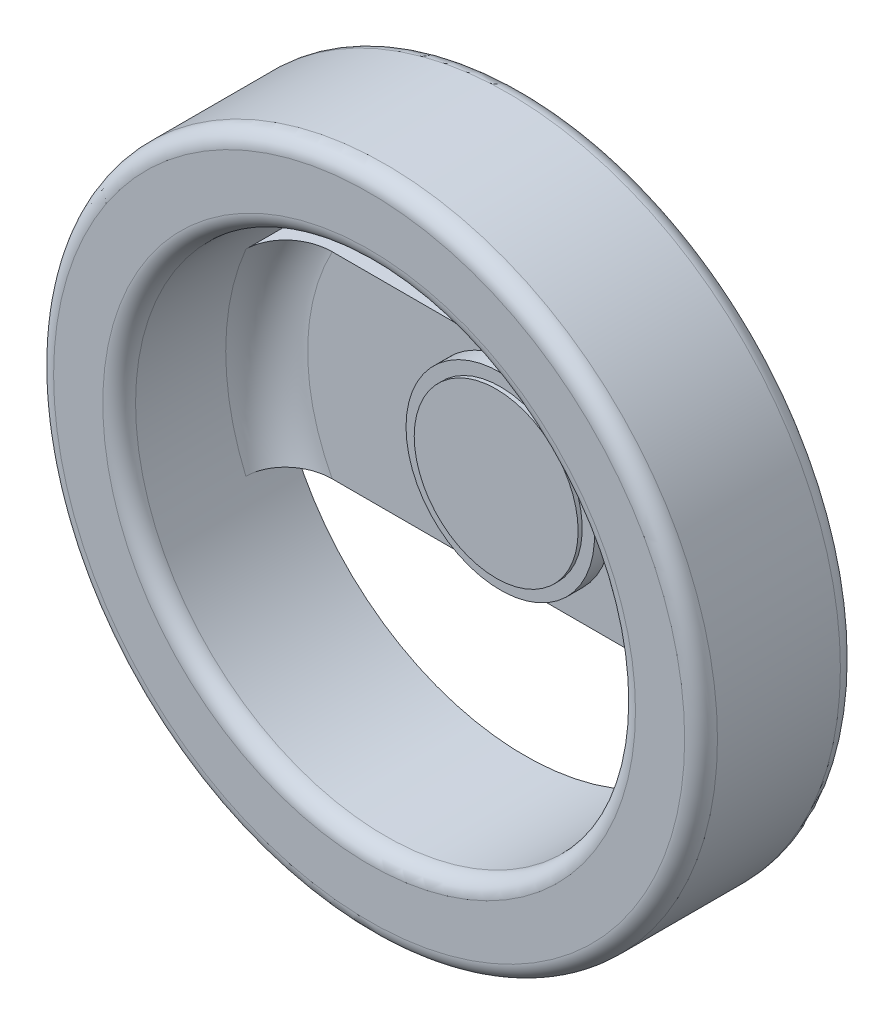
ISO-10303-21;
HEADER;
FILE_DESCRIPTION(('STEP AP214'),'2;1');
FILE_NAME('part.step','',(''),(''),'','','');
FILE_SCHEMA(('AUTOMOTIVE_DESIGN { 1 0 10303 214 1 1 1 1 }'));
ENDSEC;
DATA;
#1=APPLICATION_CONTEXT('core data for automotive mechanical design processes');
#2=APPLICATION_PROTOCOL_DEFINITION('international standard','automotive_design',2000,#1);
#3=PRODUCT_CONTEXT('',#1,'mechanical');
#4=PRODUCT('Part','Part','',(#3));
#5=PRODUCT_RELATED_PRODUCT_CATEGORY('part','',(#4));
#6=PRODUCT_DEFINITION_FORMATION('','',#4);
#7=PRODUCT_DEFINITION_CONTEXT('part definition',#1,'design');
#8=PRODUCT_DEFINITION('design','',#6,#7);
#9=PRODUCT_DEFINITION_SHAPE('','',#8);
#10=(LENGTH_UNIT() NAMED_UNIT(*) SI_UNIT(.MILLI.,.METRE.));
#11=(NAMED_UNIT(*) PLANE_ANGLE_UNIT() SI_UNIT($,.RADIAN.));
#12=(NAMED_UNIT(*) SI_UNIT($,.STERADIAN.) SOLID_ANGLE_UNIT());
#13=UNCERTAINTY_MEASURE_WITH_UNIT(LENGTH_MEASURE(1.E-05),#10,'distance_accuracy_value','');
#14=(GEOMETRIC_REPRESENTATION_CONTEXT(3) GLOBAL_UNCERTAINTY_ASSIGNED_CONTEXT((#13)) GLOBAL_UNIT_ASSIGNED_CONTEXT((#10,
#11,#12)) REPRESENTATION_CONTEXT('',''));
#15=CARTESIAN_POINT('',(0.,0.,0.));
#16=DIRECTION('',(0.,0.,1.));
#17=DIRECTION('',(1.,0.,0.));
#18=AXIS2_PLACEMENT_3D('',#15,#16,#17);
#19=CARTESIAN_POINT('',(0.,0.,2.99999999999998));
#20=DIRECTION('',(0.,0.,-1.));
#21=DIRECTION('',(-1.,0.,0.));
#22=AXIS2_PLACEMENT_3D('',#19,#20,#21);
#23=PLANE('',#22);
#24=CARTESIAN_POINT('',(0.,0.,2.99999999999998));
#25=DIRECTION('',(0.,0.,-1.));
#26=DIRECTION('',(-1.,0.,0.));
#27=AXIS2_PLACEMENT_3D('',#24,#25,#26);
#28=CIRCLE('',#27,11.5);
#29=CARTESIAN_POINT('',(-11.5,0.,2.99999999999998));
#30=VERTEX_POINT('',#29);
#31=EDGE_CURVE('E148',#30,#30,#28,.T.);
#32=ORIENTED_EDGE('',*,*,#31,.F.);
#33=EDGE_LOOP('',(#32));
#34=FACE_BOUND('',#33,.T.);
#35=CARTESIAN_POINT('',(0.,0.,2.99999999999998));
#36=DIRECTION('',(0.,0.,-1.));
#37=DIRECTION('',(-1.,0.,0.));
#38=AXIS2_PLACEMENT_3D('',#35,#36,#37);
#39=CIRCLE('',#38,10.);
#40=CARTESIAN_POINT('',(-10.,0.,2.99999999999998));
#41=VERTEX_POINT('',#40);
#42=EDGE_CURVE('E11',#41,#41,#39,.F.);
#43=ORIENTED_EDGE('',*,*,#42,.F.);
#44=EDGE_LOOP('',(#43));
#45=FACE_BOUND('',#44,.T.);
#46=ADVANCED_FACE('F26',(#34,#45),#23,.F.);
#47=CARTESIAN_POINT('',(0.,0.,0.));
#48=DIRECTION('',(0.,0.,1.));
#49=DIRECTION('',(1.,0.,0.));
#50=AXIS2_PLACEMENT_3D('',#47,#48,#49);
#51=PLANE('',#50);
#52=CARTESIAN_POINT('',(0.,0.,0.));
#53=DIRECTION('',(0.,0.,1.));
#54=DIRECTION('',(1.,0.,0.));
#55=AXIS2_PLACEMENT_3D('',#52,#53,#54);
#56=CIRCLE('',#55,38.5);
#57=CARTESIAN_POINT('',(38.5,0.,0.));
#58=VERTEX_POINT('',#57);
#59=EDGE_CURVE('E34',#58,#58,#56,.F.);
#60=ORIENTED_EDGE('',*,*,#59,.T.);
#61=EDGE_LOOP('',(#60));
#62=FACE_BOUND('',#61,.T.);
#63=DIRECTION('',(0.,-1.,0.));
#64=VECTOR('',#63,1.);
#65=CARTESIAN_POINT('',(28.0401497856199,11.9999999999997,2.1094237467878E-12));
#66=LINE('',#65,#64);
#67=CARTESIAN_POINT('',(28.0401497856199,11.9999999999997,2.1094237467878E-12));
#68=VERTEX_POINT('',#67);
#69=CARTESIAN_POINT('',(28.0401497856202,-12.0000000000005,0.));
#70=VERTEX_POINT('',#69);
#71=EDGE_CURVE('E122',#68,#70,#66,.T.);
#72=ORIENTED_EDGE('',*,*,#71,.F.);
#73=CARTESIAN_POINT('',(0.,0.,0.));
#74=DIRECTION('',(0.,0.,1.));
#75=DIRECTION('',(1.,0.,0.));
#76=AXIS2_PLACEMENT_3D('',#73,#74,#75);
#77=CIRCLE('',#76,30.5);
#78=CARTESIAN_POINT('',(-28.0401497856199,12.,0.));
#79=VERTEX_POINT('',#78);
#80=EDGE_CURVE('E159',#68,#79,#77,.T.);
#81=ORIENTED_EDGE('',*,*,#80,.T.);
#82=DIRECTION('',(0.,-1.,0.));
#83=VECTOR('',#82,1.);
#84=CARTESIAN_POINT('',(-28.0401497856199,12.,0.));
#85=LINE('',#84,#83);
#86=CARTESIAN_POINT('',(-28.0401497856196,-12.,-2.13717932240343E-12));
#87=VERTEX_POINT('',#86);
#88=EDGE_CURVE('E141',#79,#87,#85,.T.);
#89=ORIENTED_EDGE('',*,*,#88,.T.);
#90=EDGE_CURVE('E158',#87,#70,#77,.T.);
#91=ORIENTED_EDGE('',*,*,#90,.T.);
#92=EDGE_LOOP('',(#72,#81,#89,#91));
#93=FACE_BOUND('',#92,.T.);
#94=ADVANCED_FACE('F231',(#62,#93),#51,.F.);
#95=CARTESIAN_POINT('',(0.,0.,0.999999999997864));
#96=DIRECTION('',(0.,0.,-1.));
#97=DIRECTION('',(-1.,0.,0.));
#98=AXIS2_PLACEMENT_3D('',#95,#96,#97);
#99=PLANE('',#98);
#100=DIRECTION('',(-1.,0.,0.));
#101=VECTOR('',#100,1.);
#102=CARTESIAN_POINT('',(38.6813908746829,12.,1.));
#103=LINE('',#102,#101);
#104=CARTESIAN_POINT('',(22.5,12.,0.999999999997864));
#105=VERTEX_POINT('',#104);
#106=CARTESIAN_POINT('',(-22.5,11.9999999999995,1.));
#107=VERTEX_POINT('',#106);
#108=EDGE_CURVE('E156',#105,#107,#103,.T.);
#109=ORIENTED_EDGE('',*,*,#108,.T.);
#110=CARTESIAN_POINT('',(0.,0.,0.999999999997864));
#111=DIRECTION('',(0.,0.,-1.));
#112=DIRECTION('',(-1.,0.,0.));
#113=AXIS2_PLACEMENT_3D('',#110,#111,#112);
#114=CIRCLE('',#113,25.5);
#115=CARTESIAN_POINT('',(-22.4999999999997,-12.0000000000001,0.999999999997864));
#116=VERTEX_POINT('',#115);
#117=EDGE_CURVE('E48',#107,#116,#114,.F.);
#118=ORIENTED_EDGE('',*,*,#117,.T.);
#119=DIRECTION('',(1.,0.,0.));
#120=VECTOR('',#119,1.);
#121=CARTESIAN_POINT('',(-38.6813908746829,-12.0000000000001,0.999999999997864));
#122=LINE('',#121,#120);
#123=CARTESIAN_POINT('',(22.5000000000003,-12.0000000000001,0.999999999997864));
#124=VERTEX_POINT('',#123);
#125=EDGE_CURVE('E154',#116,#124,#122,.T.);
#126=ORIENTED_EDGE('',*,*,#125,.T.);
#127=CARTESIAN_POINT('',(0.,0.,0.999999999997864));
#128=DIRECTION('',(0.,0.,-1.));
#129=DIRECTION('',(-1.,0.,0.));
#130=AXIS2_PLACEMENT_3D('',#127,#128,#129);
#131=CIRCLE('',#130,25.5);
#132=EDGE_CURVE('E187',#124,#105,#131,.F.);
#133=ORIENTED_EDGE('',*,*,#132,.T.);
#134=EDGE_LOOP('',(#109,#118,#126,#133));
#135=FACE_BOUND('',#134,.T.);
#136=CARTESIAN_POINT('',(0.,0.,0.999999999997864));
#137=DIRECTION('',(0.,0.,-1.));
#138=DIRECTION('',(-1.,0.,0.));
#139=AXIS2_PLACEMENT_3D('',#136,#137,#138);
#140=CIRCLE('',#139,11.5);
#141=CARTESIAN_POINT('',(-11.5,0.,0.999999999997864));
#142=VERTEX_POINT('',#141);
#143=EDGE_CURVE('E171',#142,#142,#140,.F.);
#144=ORIENTED_EDGE('',*,*,#143,.F.);
#145=EDGE_LOOP('',(#144));
#146=FACE_BOUND('',#145,.T.);
#147=ADVANCED_FACE('F238',(#135,#146),#99,.F.);
#148=CARTESIAN_POINT('',(0.,0.,19.));
#149=DIRECTION('',(0.,0.,-1.));
#150=DIRECTION('',(-1.,0.,0.));
#151=AXIS2_PLACEMENT_3D('',#148,#149,#150);
#152=CYLINDRICAL_SURFACE('',#151,30.5);
#153=CARTESIAN_POINT('',(0.,0.,16.9999999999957));
#154=DIRECTION('',(0.,0.,1.));
#155=DIRECTION('',(1.,0.,0.));
#156=AXIS2_PLACEMENT_3D('',#153,#154,#155);
#157=CIRCLE('',#156,30.5);
#158=CARTESIAN_POINT('',(30.5,0.,16.9999999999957));
#159=VERTEX_POINT('',#158);
#160=EDGE_CURVE('E304',#159,#159,#157,.T.);
#161=ORIENTED_EDGE('',*,*,#160,.T.);
#162=EDGE_LOOP('',(#161));
#163=FACE_BOUND('',#162,.T.);
#164=CARTESIAN_POINT('',(0.,0.,5.99999999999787));
#165=DIRECTION('',(0.,0.,-1.));
#166=DIRECTION('',(-1.,0.,0.));
#167=AXIS2_PLACEMENT_3D('',#164,#165,#166);
#168=CIRCLE('',#167,30.5);
#169=CARTESIAN_POINT('',(-28.0401497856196,-12.,5.99999999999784));
#170=VERTEX_POINT('',#169);
#171=CARTESIAN_POINT('',(-28.0401497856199,12.,5.99999999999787));
#172=VERTEX_POINT('',#171);
#173=EDGE_CURVE('E184',#170,#172,#168,.T.);
#174=ORIENTED_EDGE('',*,*,#173,.T.);
#175=DIRECTION('',(0.,0.,-1.));
#176=VECTOR('',#175,1.);
#177=CARTESIAN_POINT('',(-28.0401497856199,11.9999999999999,18.9999999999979));
#178=LINE('',#177,#176);
#179=EDGE_CURVE('E164',#172,#79,#178,.T.);
#180=ORIENTED_EDGE('',*,*,#179,.T.);
#181=ORIENTED_EDGE('',*,*,#80,.F.);
#182=DIRECTION('',(0.,0.,-1.));
#183=VECTOR('',#182,1.);
#184=CARTESIAN_POINT('',(28.0401497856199,11.9999999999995,19.));
#185=LINE('',#184,#183);
#186=CARTESIAN_POINT('',(28.0401497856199,11.9999999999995,6.00000000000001));
#187=VERTEX_POINT('',#186);
#188=EDGE_CURVE('E169',#68,#187,#185,.F.);
#189=ORIENTED_EDGE('',*,*,#188,.T.);
#190=CARTESIAN_POINT('',(0.,0.,5.99999999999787));
#191=DIRECTION('',(0.,0.,-1.));
#192=DIRECTION('',(-1.,0.,0.));
#193=AXIS2_PLACEMENT_3D('',#190,#191,#192);
#194=CIRCLE('',#193,30.5);
#195=CARTESIAN_POINT('',(28.0401497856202,-12.0000000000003,5.99999999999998));
#196=VERTEX_POINT('',#195);
#197=EDGE_CURVE('E181',#187,#196,#194,.T.);
#198=ORIENTED_EDGE('',*,*,#197,.T.);
#199=DIRECTION('',(0.,0.,-1.));
#200=VECTOR('',#199,1.);
#201=CARTESIAN_POINT('',(28.0401497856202,-12.0000000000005,19.));
#202=LINE('',#201,#200);
#203=EDGE_CURVE('E167',#196,#70,#202,.T.);
#204=ORIENTED_EDGE('',*,*,#203,.T.);
#205=ORIENTED_EDGE('',*,*,#90,.F.);
#206=DIRECTION('',(0.,0.,-1.));
#207=VECTOR('',#206,1.);
#208=CARTESIAN_POINT('',(-28.0401497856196,-12.,18.9999999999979));
#209=LINE('',#208,#207);
#210=EDGE_CURVE('E162',#87,#170,#209,.F.);
#211=ORIENTED_EDGE('',*,*,#210,.T.);
#212=EDGE_LOOP('',(#174,#180,#181,#189,#198,#204,#205,#211));
#213=FACE_BOUND('',#212,.T.);
#214=ADVANCED_FACE('F240',(#163,#213),#152,.F.);
#215=CARTESIAN_POINT('',(0.,0.,19.));
#216=DIRECTION('',(0.,0.,1.));
#217=DIRECTION('',(1.,0.,0.));
#218=AXIS2_PLACEMENT_3D('',#215,#216,#217);
#219=PLANE('',#218);
#220=CARTESIAN_POINT('',(0.,0.,19.));
#221=DIRECTION('',(0.,0.,1.));
#222=DIRECTION('',(1.,0.,0.));
#223=AXIS2_PLACEMENT_3D('',#220,#221,#222);
#224=CIRCLE('',#223,32.5);
#225=CARTESIAN_POINT('',(32.5,0.,19.));
#226=VERTEX_POINT('',#225);
#227=EDGE_CURVE('E301',#226,#226,#224,.F.);
#228=ORIENTED_EDGE('',*,*,#227,.T.);
#229=EDGE_LOOP('',(#228));
#230=FACE_BOUND('',#229,.T.);
#231=CARTESIAN_POINT('',(0.,0.,19.));
#232=DIRECTION('',(0.,0.,1.));
#233=DIRECTION('',(1.,0.,0.));
#234=AXIS2_PLACEMENT_3D('',#231,#232,#233);
#235=CIRCLE('',#234,38.5);
#236=CARTESIAN_POINT('',(38.5,0.,19.));
#237=VERTEX_POINT('',#236);
#238=EDGE_CURVE('E305',#237,#237,#235,.T.);
#239=ORIENTED_EDGE('',*,*,#238,.T.);
#240=EDGE_LOOP('',(#239));
#241=FACE_BOUND('',#240,.T.);
#242=ADVANCED_FACE('F246',(#230,#241),#219,.T.);
#243=CARTESIAN_POINT('',(0.,0.,19.));
#244=DIRECTION('',(0.,0.,-1.));
#245=DIRECTION('',(-1.,0.,0.));
#246=AXIS2_PLACEMENT_3D('',#243,#244,#245);
#247=CYLINDRICAL_SURFACE('',#246,40.5);
#248=CARTESIAN_POINT('',(0.,0.,1.99999999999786));
#249=DIRECTION('',(0.,0.,1.));
#250=DIRECTION('',(1.,0.,0.));
#251=AXIS2_PLACEMENT_3D('',#248,#249,#250);
#252=CIRCLE('',#251,40.5);
#253=CARTESIAN_POINT('',(40.5,0.,1.99999999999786));
#254=VERTEX_POINT('',#253);
#255=EDGE_CURVE('E320',#254,#254,#252,.T.);
#256=ORIENTED_EDGE('',*,*,#255,.T.);
#257=EDGE_LOOP('',(#256));
#258=FACE_BOUND('',#257,.T.);
#259=CARTESIAN_POINT('',(0.,0.,16.9999999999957));
#260=DIRECTION('',(0.,0.,1.));
#261=DIRECTION('',(1.,0.,0.));
#262=AXIS2_PLACEMENT_3D('',#259,#260,#261);
#263=CIRCLE('',#262,40.5);
#264=CARTESIAN_POINT('',(40.5,0.,16.9999999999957));
#265=VERTEX_POINT('',#264);
#266=EDGE_CURVE('E317',#265,#265,#263,.F.);
#267=ORIENTED_EDGE('',*,*,#266,.T.);
#268=EDGE_LOOP('',(#267));
#269=FACE_BOUND('',#268,.T.);
#270=ADVANCED_FACE('F28',(#258,#269),#247,.T.);
#271=CARTESIAN_POINT('',(38.6813908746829,12.,1.));
#272=DIRECTION('',(0.,-1.,0.));
#273=DIRECTION('',(0.,0.,-1.));
#274=AXIS2_PLACEMENT_3D('',#271,#272,#273);
#275=PLANE('',#274);
#276=ORIENTED_EDGE('',*,*,#179,.F.);
#277=CARTESIAN_POINT('',(-28.0401497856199,12.,5.99999999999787));
#278=CARTESIAN_POINT('',(-28.0401705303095,12.,5.86795696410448));
#279=CARTESIAN_POINT('',(-28.0344612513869,12.,5.73591951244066));
#280=CARTESIAN_POINT('',(-28.0117345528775,12.,5.47284540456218));
#281=CARTESIAN_POINT('',(-27.994719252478,12.,5.3418085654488));
#282=CARTESIAN_POINT('',(-27.949593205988,12.,5.08202565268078));
#283=CARTESIAN_POINT('',(-27.921512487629,12.,4.95327435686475));
#284=CARTESIAN_POINT('',(-27.8545418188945,12.,4.69861523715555));
#285=CARTESIAN_POINT('',(-27.8156517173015,12.0000000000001,4.57270745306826));
#286=CARTESIAN_POINT('',(-27.7274596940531,12.0000000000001,4.32465649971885));
#287=CARTESIAN_POINT('',(-27.6781621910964,12.,4.20251175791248));
#288=CARTESIAN_POINT('',(-27.5695932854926,12.,3.96268847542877));
#289=CARTESIAN_POINT('',(-27.5103181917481,12.,3.8450116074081));
#290=CARTESIAN_POINT('',(-27.3823506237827,12.,3.61490604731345));
#291=CARTESIAN_POINT('',(-27.313658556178,12.,3.50247712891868));
#292=CARTESIAN_POINT('',(-27.1674315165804,12.,3.28347243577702));
#293=CARTESIAN_POINT('',(-27.0898931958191,12.,3.17689890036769));
#294=CARTESIAN_POINT('',(-26.9242958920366,12.,2.96725435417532));
#295=CARTESIAN_POINT('',(-26.8359993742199,12.,2.86437079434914));
#296=CARTESIAN_POINT('',(-26.6514836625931,12.,2.66595026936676));
#297=CARTESIAN_POINT('',(-26.5552616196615,12.,2.57041597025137));
#298=CARTESIAN_POINT('',(-26.2558953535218,12.,2.29559861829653));
#299=CARTESIAN_POINT('',(-26.0419054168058,11.9999999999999,2.1279183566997));
#300=CARTESIAN_POINT('',(-25.5743816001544,11.9999999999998,1.8149674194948));
#301=CARTESIAN_POINT('',(-25.319079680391,12.,1.67235961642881));
#302=CARTESIAN_POINT('',(-24.7895640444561,12.,1.42767007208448));
#303=CARTESIAN_POINT('',(-24.5153318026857,12.,1.32562870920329));
#304=CARTESIAN_POINT('',(-23.9533792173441,12.,1.16221389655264));
#305=CARTESIAN_POINT('',(-23.6655937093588,12.,1.10106432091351));
#306=CARTESIAN_POINT('',(-23.2301930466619,12.,1.04024492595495));
#307=CARTESIAN_POINT('',(-23.0845607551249,12.,1.02512239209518));
#308=CARTESIAN_POINT('',(-22.7926327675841,11.9999999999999,1.00500384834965));
#309=CARTESIAN_POINT('',(-22.6463372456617,11.9999999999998,1.00000531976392));
#310=CARTESIAN_POINT('',(-22.5,11.9999999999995,1.));
#311=B_SPLINE_CURVE_WITH_KNOTS('',3,(#277,#278,#279,#280,#281,#282,#283,#284,#285,#286,#287,
#288,#289,#290,#291,#292,#293,#294,#295,#296,#297,#298,#299,#300,#301,#302,#303,#304,#305,#306,
#307,#308,#309,#310),.UNSPECIFIED.,.F.,.F.,(4,2,2,2,2,2,2,2,2,2,2,2,2,2,2,2,4),(0.,
0.395997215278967,0.791920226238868,1.18677615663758,1.58163761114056,1.97633175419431,
2.37117223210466,2.76599566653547,3.16096906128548,3.5672430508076,3.97366373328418,
4.78581195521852,5.65953451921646,6.53412459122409,7.4134644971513,7.85241086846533,
8.29124802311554),.UNSPECIFIED.);
#312=EDGE_CURVE('E190',#172,#107,#311,.T.);
#313=ORIENTED_EDGE('',*,*,#312,.T.);
#314=ORIENTED_EDGE('',*,*,#108,.F.);
#315=CARTESIAN_POINT('',(22.5,12.,0.999999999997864));
#316=CARTESIAN_POINT('',(22.670881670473,12.,0.999992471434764));
#317=CARTESIAN_POINT('',(22.8417847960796,12.,1.00682027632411));
#318=CARTESIAN_POINT('',(23.1825412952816,12.,1.03431113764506));
#319=CARTESIAN_POINT('',(23.3523942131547,12.,1.0549798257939));
#320=CARTESIAN_POINT('',(23.69051590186,12.,1.11043199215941));
#321=CARTESIAN_POINT('',(23.8587751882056,12.0000000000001,1.14527362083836));
#322=CARTESIAN_POINT('',(24.1917044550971,11.9999999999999,1.22915438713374));
#323=CARTESIAN_POINT('',(24.3563748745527,11.9999999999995,1.27819177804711));
#324=CARTESIAN_POINT('',(24.68130724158,11.9999999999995,1.3906405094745));
#325=CARTESIAN_POINT('',(24.8415542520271,11.9999999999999,1.45409512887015));
#326=CARTESIAN_POINT('',(25.1556830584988,12.0000000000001,1.59518059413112));
#327=CARTESIAN_POINT('',(25.3095652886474,12.,1.67281047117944));
#328=CARTESIAN_POINT('',(25.6092308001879,12.,1.84185568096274));
#329=CARTESIAN_POINT('',(25.755027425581,12.0000000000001,1.93324731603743));
#330=CARTESIAN_POINT('',(26.0372597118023,11.9999999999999,2.12949357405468));
#331=CARTESIAN_POINT('',(26.1736964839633,11.9999999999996,2.23434659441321));
#332=CARTESIAN_POINT('',(26.4244305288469,11.9999999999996,2.44736815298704));
#333=CARTESIAN_POINT('',(26.5396231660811,11.9999999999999,2.55448362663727));
#334=CARTESIAN_POINT('',(26.7596893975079,12.0000000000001,2.7788310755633));
#335=CARTESIAN_POINT('',(26.8645642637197,12.,2.89606180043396));
#336=CARTESIAN_POINT('',(27.0628608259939,12.,3.13988505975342));
#337=CARTESIAN_POINT('',(27.1562804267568,12.0000000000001,3.26647930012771));
#338=CARTESIAN_POINT('',(27.3305312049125,11.9999999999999,3.52804908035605));
#339=CARTESIAN_POINT('',(27.4113639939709,11.9999999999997,3.66302354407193));
#340=CARTESIAN_POINT('',(27.5521210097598,11.9999999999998,3.92653511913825));
#341=CARTESIAN_POINT('',(27.613321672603,11.9999999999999,4.05439186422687));
#342=CARTESIAN_POINT('',(27.7240298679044,12.,4.31506459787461));
#343=CARTESIAN_POINT('',(27.7735387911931,12.,4.44787999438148));
#344=CARTESIAN_POINT('',(27.8602475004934,12.,4.71722387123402));
#345=CARTESIAN_POINT('',(27.8974677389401,12.0000000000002,4.85374576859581));
#346=CARTESIAN_POINT('',(27.9592745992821,11.9999999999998,5.12956006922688));
#347=CARTESIAN_POINT('',(27.9838679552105,11.9999999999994,5.26885095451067));
#348=CARTESIAN_POINT('',(28.0147129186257,11.9999999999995,5.50700090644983));
#349=CARTESIAN_POINT('',(28.0242542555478,11.9999999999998,5.60544602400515));
#350=CARTESIAN_POINT('',(28.0369699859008,12.0000000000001,5.80259028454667));
#351=CARTESIAN_POINT('',(28.0401544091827,12.0000000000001,5.90128878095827));
#352=CARTESIAN_POINT('',(28.0401497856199,11.9999999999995,6.00000000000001));
#353=B_SPLINE_CURVE_WITH_KNOTS('',3,(#315,#316,#317,#318,#319,#320,#321,#322,#323,#324,#325,
#326,#327,#328,#329,#330,#331,#332,#333,#334,#335,#336,#337,#338,#339,#340,#341,#342,#343,#344,
#345,#346,#347,#348,#349,#350,#351,#352),.UNSPECIFIED.,.F.,.F.,(4,2,2,2,2,2,2,2,2,2,2,2,2,2,2,2,
2,2,4),(0.,0.512541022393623,1.02529071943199,1.54016575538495,2.05497746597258,
2.57135549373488,3.08769824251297,3.6031618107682,4.11856406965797,4.58982462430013,
5.06102700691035,5.53231544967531,6.00354349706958,6.42824143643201,6.85288882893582,
7.27682586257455,7.7005365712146,7.99706226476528,8.29311973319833),.UNSPECIFIED.);
#354=EDGE_CURVE('E306',#105,#187,#353,.T.);
#355=ORIENTED_EDGE('',*,*,#354,.T.);
#356=ORIENTED_EDGE('',*,*,#188,.F.);
#357=DIRECTION('',(-0.90630778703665,0.,-0.4226182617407));
#358=VECTOR('',#357,1.);
#359=CARTESIAN_POINT('',(28.0401497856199,11.9999999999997,2.1094237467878E-12));
#360=LINE('',#359,#358);
#361=CARTESIAN_POINT('',(2.30606673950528,12.,-12.0000000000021));
#362=VERTEX_POINT('',#361);
#363=EDGE_CURVE('E130',#68,#362,#360,.T.);
#364=ORIENTED_EDGE('',*,*,#363,.T.);
#365=DIRECTION('',(1.,0.,0.));
#366=VECTOR('',#365,1.);
#367=CARTESIAN_POINT('',(-2.30606673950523,11.9999999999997,-12.0000000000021));
#368=LINE('',#367,#366);
#369=CARTESIAN_POINT('',(-2.30606673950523,11.9999999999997,-12.0000000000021));
#370=VERTEX_POINT('',#369);
#371=EDGE_CURVE('E135',#370,#362,#368,.T.);
#372=ORIENTED_EDGE('',*,*,#371,.F.);
#373=DIRECTION('',(0.906307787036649,0.,-0.4226182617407));
#374=VECTOR('',#373,1.);
#375=CARTESIAN_POINT('',(-28.0401497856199,12.,0.));
#376=LINE('',#375,#374);
#377=EDGE_CURVE('E138',#79,#370,#376,.T.);
#378=ORIENTED_EDGE('',*,*,#377,.F.);
#379=EDGE_LOOP('',(#276,#313,#314,#355,#356,#364,#372,#378));
#380=FACE_BOUND('',#379,.T.);
#381=ADVANCED_FACE('F203',(#380),#275,.F.);
#382=CARTESIAN_POINT('',(-38.6813908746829,-12.0000000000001,0.999999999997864));
#383=DIRECTION('',(0.,1.,0.));
#384=DIRECTION('',(-1.,0.,0.));
#385=AXIS2_PLACEMENT_3D('',#382,#383,#384);
#386=PLANE('',#385);
#387=ORIENTED_EDGE('',*,*,#203,.F.);
#388=CARTESIAN_POINT('',(28.0401497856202,-12.0000000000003,5.99999999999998));
#389=CARTESIAN_POINT('',(28.0401705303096,-12.0000000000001,5.8679569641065));
#390=CARTESIAN_POINT('',(28.034461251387,-12.0000000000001,5.73591951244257));
#391=CARTESIAN_POINT('',(28.0117345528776,-12.0000000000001,5.47284540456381));
#392=CARTESIAN_POINT('',(27.9947192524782,-12.0000000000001,5.34180856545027));
#393=CARTESIAN_POINT('',(27.9495932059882,-12.0000000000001,5.08202565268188));
#394=CARTESIAN_POINT('',(27.9215124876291,-12.,4.95327435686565));
#395=CARTESIAN_POINT('',(27.8545418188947,-12.0000000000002,4.69861523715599));
#396=CARTESIAN_POINT('',(27.8156517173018,-12.0000000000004,4.57270745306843));
#397=CARTESIAN_POINT('',(27.7274596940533,-12.0000000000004,4.32465649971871));
#398=CARTESIAN_POINT('',(27.6781621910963,-12.0000000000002,4.20251175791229));
#399=CARTESIAN_POINT('',(27.5695932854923,-12.,3.9626884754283));
#400=CARTESIAN_POINT('',(27.5103181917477,-12.0000000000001,3.8450116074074));
#401=CARTESIAN_POINT('',(27.382350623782,-12.0000000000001,3.61490604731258));
#402=CARTESIAN_POINT('',(27.313658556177,-12.0000000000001,3.50247712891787));
#403=CARTESIAN_POINT('',(27.1674315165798,-12.0000000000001,3.28347243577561));
#404=CARTESIAN_POINT('',(27.0898931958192,-12.0000000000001,3.17689890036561));
#405=CARTESIAN_POINT('',(26.9242958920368,-12.0000000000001,2.96725435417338));
#406=CARTESIAN_POINT('',(26.8359993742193,-12.0000000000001,2.86437079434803));
#407=CARTESIAN_POINT('',(26.6514836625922,-12.0000000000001,2.66595026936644));
#408=CARTESIAN_POINT('',(26.5552616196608,-12.0000000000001,2.57041597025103));
#409=CARTESIAN_POINT('',(26.2558953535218,-12.0000000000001,2.29559861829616));
#410=CARTESIAN_POINT('',(26.0419054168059,-11.9999999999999,2.1279183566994));
#411=CARTESIAN_POINT('',(25.5743816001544,-11.9999999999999,1.81496741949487));
#412=CARTESIAN_POINT('',(25.3190796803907,-12.0000000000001,1.67235961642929));
#413=CARTESIAN_POINT('',(24.7895640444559,-12.0000000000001,1.42767007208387));
#414=CARTESIAN_POINT('',(24.515331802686,-12.,1.32562870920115));
#415=CARTESIAN_POINT('',(23.9533792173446,-12.,1.16221389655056));
#416=CARTESIAN_POINT('',(23.6655937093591,-12.0000000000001,1.10106432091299));
#417=CARTESIAN_POINT('',(23.2301930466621,-12.0000000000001,1.04024492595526));
#418=CARTESIAN_POINT('',(23.084560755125,-12.0000000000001,1.02512239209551));
#419=CARTESIAN_POINT('',(22.7926327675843,-12.0000000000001,1.00500384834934));
#420=CARTESIAN_POINT('',(22.6463372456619,-12.0000000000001,1.00000531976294));
#421=CARTESIAN_POINT('',(22.5000000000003,-12.0000000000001,0.999999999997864));
#422=B_SPLINE_CURVE_WITH_KNOTS('',3,(#388,#389,#390,#391,#392,#393,#394,#395,#396,#397,#398,
#399,#400,#401,#402,#403,#404,#405,#406,#407,#408,#409,#410,#411,#412,#413,#414,#415,#416,#417,
#418,#419,#420,#421),.UNSPECIFIED.,.F.,.F.,(4,2,2,2,2,2,2,2,2,2,2,2,2,2,2,2,4),(0.,
0.395997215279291,0.791920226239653,1.18677615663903,1.58163761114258,1.9763317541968,
2.37117223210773,2.76599566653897,3.16096906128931,3.56724305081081,3.97366373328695,
4.78581195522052,5.65953451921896,6.53412459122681,7.41346449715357,7.85241086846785,
8.29124802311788),.UNSPECIFIED.);
#423=EDGE_CURVE('E41',#196,#124,#422,.T.);
#424=ORIENTED_EDGE('',*,*,#423,.T.);
#425=ORIENTED_EDGE('',*,*,#125,.F.);
#426=CARTESIAN_POINT('',(-22.4999999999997,-12.0000000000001,0.999999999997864));
#427=CARTESIAN_POINT('',(-22.6708816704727,-12.0000000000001,0.999992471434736));
#428=CARTESIAN_POINT('',(-22.8417847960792,-12.0000000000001,1.00682027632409));
#429=CARTESIAN_POINT('',(-23.1825412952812,-12.0000000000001,1.03431113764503));
#430=CARTESIAN_POINT('',(-23.3523942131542,-12.0000000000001,1.05497982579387));
#431=CARTESIAN_POINT('',(-23.6905159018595,-12.0000000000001,1.11043199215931));
#432=CARTESIAN_POINT('',(-23.8587751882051,-12.0000000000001,1.1452736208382));
#433=CARTESIAN_POINT('',(-24.1917044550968,-12.0000000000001,1.22915438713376));
#434=CARTESIAN_POINT('',(-24.3563748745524,-12.,1.27819177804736));
#435=CARTESIAN_POINT('',(-24.6813072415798,-12.,1.39064050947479));
#436=CARTESIAN_POINT('',(-24.841554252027,-12.0000000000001,1.45409512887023));
#437=CARTESIAN_POINT('',(-25.1556830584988,-12.0000000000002,1.59518059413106));
#438=CARTESIAN_POINT('',(-25.3095652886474,-12.0000000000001,1.67281047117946));
#439=CARTESIAN_POINT('',(-25.6092308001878,-12.0000000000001,1.84185568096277));
#440=CARTESIAN_POINT('',(-25.755027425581,-12.,1.93324731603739));
#441=CARTESIAN_POINT('',(-26.0372597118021,-12.0000000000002,2.12949357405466));
#442=CARTESIAN_POINT('',(-26.173696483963,-12.0000000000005,2.23434659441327));
#443=CARTESIAN_POINT('',(-26.4244305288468,-12.0000000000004,2.44736815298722));
#444=CARTESIAN_POINT('',(-26.5396231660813,-12.0000000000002,2.55448362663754));
#445=CARTESIAN_POINT('',(-26.7596893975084,-12.,2.77883107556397));
#446=CARTESIAN_POINT('',(-26.8645642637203,-12.0000000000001,2.89606180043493));
#447=CARTESIAN_POINT('',(-27.062860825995,-12.0000000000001,3.13988505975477));
#448=CARTESIAN_POINT('',(-27.1562804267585,-12.0000000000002,3.26647930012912));
#449=CARTESIAN_POINT('',(-27.3305312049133,-12.0000000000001,3.52804908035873));
#450=CARTESIAN_POINT('',(-27.4113639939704,-12.,3.66302354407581));
#451=CARTESIAN_POINT('',(-27.5521210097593,-12.,3.9265351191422));
#452=CARTESIAN_POINT('',(-27.6133216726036,-12.0000000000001,4.0543918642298));
#453=CARTESIAN_POINT('',(-27.7240298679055,-12.0000000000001,4.31506459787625));
#454=CARTESIAN_POINT('',(-27.7735387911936,-12.0000000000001,4.44787999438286));
#455=CARTESIAN_POINT('',(-27.8602475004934,-12.0000000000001,4.71722387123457));
#456=CARTESIAN_POINT('',(-27.8974677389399,-12.0000000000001,4.85374576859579));
#457=CARTESIAN_POINT('',(-27.9592745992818,-12.0000000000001,5.12956006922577));
#458=CARTESIAN_POINT('',(-27.9838679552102,-12.,5.26885095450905));
#459=CARTESIAN_POINT('',(-28.0147129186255,-12.,5.50700090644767));
#460=CARTESIAN_POINT('',(-28.0242542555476,-12.0000000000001,5.60544602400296));
#461=CARTESIAN_POINT('',(-28.0369699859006,-12.0000000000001,5.80259028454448));
#462=CARTESIAN_POINT('',(-28.0401544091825,-12.0000000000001,5.90128878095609));
#463=CARTESIAN_POINT('',(-28.0401497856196,-12.,5.99999999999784));
#464=B_SPLINE_CURVE_WITH_KNOTS('',3,(#426,#427,#428,#429,#430,#431,#432,#433,#434,#435,#436,
#437,#438,#439,#440,#441,#442,#443,#444,#445,#446,#447,#448,#449,#450,#451,#452,#453,#454,#455,
#456,#457,#458,#459,#460,#461,#462,#463),.UNSPECIFIED.,.F.,.F.,(4,2,2,2,2,2,2,2,2,2,2,2,2,2,2,2,
2,2,4),(0.,0.512541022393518,1.0252907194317,1.54016575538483,2.05497746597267,2.57135549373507,
3.08769824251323,3.6031618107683,4.118564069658,4.58982462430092,5.06102700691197,
5.53231544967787,6.0035434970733,6.42824143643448,6.85288882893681,7.2768258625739,
7.70053657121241,7.99706226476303,8.29311973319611),.UNSPECIFIED.);
#465=EDGE_CURVE('E197',#116,#170,#464,.T.);
#466=ORIENTED_EDGE('',*,*,#465,.T.);
#467=ORIENTED_EDGE('',*,*,#210,.F.);
#468=DIRECTION('',(0.906307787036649,0.,-0.4226182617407));
#469=VECTOR('',#468,1.);
#470=CARTESIAN_POINT('',(-28.0401497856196,-12.,-2.13717932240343E-12));
#471=LINE('',#470,#469);
#472=CARTESIAN_POINT('',(-2.30606673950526,-12.,-12.));
#473=VERTEX_POINT('',#472);
#474=EDGE_CURVE('E128',#87,#473,#471,.T.);
#475=ORIENTED_EDGE('',*,*,#474,.T.);
#476=DIRECTION('',(1.,0.,0.));
#477=VECTOR('',#476,1.);
#478=CARTESIAN_POINT('',(-2.30606673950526,-12.,-12.));
#479=LINE('',#478,#477);
#480=CARTESIAN_POINT('',(2.30606673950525,-12.,-12.));
#481=VERTEX_POINT('',#480);
#482=EDGE_CURVE('E109',#473,#481,#479,.T.);
#483=ORIENTED_EDGE('',*,*,#482,.T.);
#484=DIRECTION('',(-0.90630778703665,0.,-0.4226182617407));
#485=VECTOR('',#484,1.);
#486=CARTESIAN_POINT('',(28.0401497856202,-12.0000000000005,0.));
#487=LINE('',#486,#485);
#488=EDGE_CURVE('E119',#70,#481,#487,.T.);
#489=ORIENTED_EDGE('',*,*,#488,.F.);
#490=EDGE_LOOP('',(#387,#424,#425,#466,#467,#475,#483,#489));
#491=FACE_BOUND('',#490,.T.);
#492=ADVANCED_FACE('F126',(#491),#386,.F.);
#493=CARTESIAN_POINT('',(0.,-4.5102810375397E-13,-16.0000000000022));
#494=DIRECTION('',(0.,0.,1.));
#495=DIRECTION('',(1.,0.,0.));
#496=AXIS2_PLACEMENT_3D('',#493,#494,#495);
#497=CYLINDRICAL_SURFACE('',#496,11.5);
#498=ORIENTED_EDGE('',*,*,#31,.T.);
#499=EDGE_LOOP('',(#498));
#500=FACE_BOUND('',#499,.T.);
#501=ORIENTED_EDGE('',*,*,#143,.T.);
#502=EDGE_LOOP('',(#501));
#503=FACE_BOUND('',#502,.T.);
#504=ADVANCED_FACE('F228',(#500,#503),#497,.T.);
#505=CARTESIAN_POINT('',(28.0401497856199,11.9999999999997,2.1094237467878E-12));
#506=DIRECTION('',(-0.4226182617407,0.,0.90630778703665));
#507=DIRECTION('',(0.90630778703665,0.,0.4226182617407));
#508=AXIS2_PLACEMENT_3D('',#505,#506,#507);
#509=PLANE('',#508);
#510=DIRECTION('',(0.,-1.,0.));
#511=VECTOR('',#510,1.);
#512=CARTESIAN_POINT('',(2.30606673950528,12.,-12.0000000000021));
#513=LINE('',#512,#511);
#514=CARTESIAN_POINT('',(2.30606673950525,-11.2664127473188,-12.));
#515=VERTEX_POINT('',#514);
#516=EDGE_CURVE('E104',#515,#481,#513,.T.);
#517=ORIENTED_EDGE('',*,*,#516,.F.);
#518=CARTESIAN_POINT('',(0.,0.,-13.0753365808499));
#519=DIRECTION('',(-0.4226182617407,0.,0.90630778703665));
#520=DIRECTION('',(0.90630778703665,0.,0.4226182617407));
#521=AXIS2_PLACEMENT_3D('',#518,#519,#520);
#522=ELLIPSE('',#521,12.6888460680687,11.5);
#523=CARTESIAN_POINT('',(2.30606673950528,11.2664127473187,-12.0000000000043));
#524=VERTEX_POINT('',#523);
#525=EDGE_CURVE('E179',#515,#524,#522,.T.);
#526=ORIENTED_EDGE('',*,*,#525,.T.);
#527=EDGE_CURVE('E115',#362,#524,#513,.T.);
#528=ORIENTED_EDGE('',*,*,#527,.F.);
#529=ORIENTED_EDGE('',*,*,#363,.F.);
#530=ORIENTED_EDGE('',*,*,#71,.T.);
#531=ORIENTED_EDGE('',*,*,#488,.T.);
#532=EDGE_LOOP('',(#517,#526,#528,#529,#530,#531));
#533=FACE_BOUND('',#532,.T.);
#534=ADVANCED_FACE('F120',(#533),#509,.F.);
#535=CARTESIAN_POINT('',(-2.30606673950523,11.9999999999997,-12.0000000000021));
#536=DIRECTION('',(0.,0.,-1.));
#537=DIRECTION('',(-1.,0.,0.));
#538=AXIS2_PLACEMENT_3D('',#535,#536,#537);
#539=PLANE('',#538);
#540=CARTESIAN_POINT('',(0.,-3.81639164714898E-13,-12.0000000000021));
#541=DIRECTION('',(0.,0.,-1.));
#542=DIRECTION('',(-1.,0.,0.));
#543=AXIS2_PLACEMENT_3D('',#540,#541,#542);
#544=CIRCLE('',#543,11.5);
#545=CARTESIAN_POINT('',(-2.30606673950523,11.2664127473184,-12.0000000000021));
#546=VERTEX_POINT('',#545);
#547=EDGE_CURVE('E178',#546,#524,#544,.T.);
#548=ORIENTED_EDGE('',*,*,#547,.F.);
#549=DIRECTION('',(0.,-1.,0.));
#550=VECTOR('',#549,1.);
#551=CARTESIAN_POINT('',(-2.30606673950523,11.9999999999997,-12.0000000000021));
#552=LINE('',#551,#550);
#553=EDGE_CURVE('E116',#370,#546,#552,.T.);
#554=ORIENTED_EDGE('',*,*,#553,.F.);
#555=ORIENTED_EDGE('',*,*,#371,.T.);
#556=ORIENTED_EDGE('',*,*,#527,.T.);
#557=EDGE_LOOP('',(#548,#554,#555,#556));
#558=FACE_BOUND('',#557,.T.);
#559=ADVANCED_FACE('F222',(#558),#539,.T.);
#560=CARTESIAN_POINT('',(-2.30606673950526,-11.2664127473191,-12.));
#561=VERTEX_POINT('',#560);
#562=EDGE_CURVE('E112',#515,#561,#544,.T.);
#563=ORIENTED_EDGE('',*,*,#562,.F.);
#564=ORIENTED_EDGE('',*,*,#516,.T.);
#565=ORIENTED_EDGE('',*,*,#482,.F.);
#566=EDGE_CURVE('E144',#561,#473,#552,.T.);
#567=ORIENTED_EDGE('',*,*,#566,.F.);
#568=EDGE_LOOP('',(#563,#564,#565,#567));
#569=FACE_BOUND('',#568,.T.);
#570=ADVANCED_FACE('F106',(#569),#539,.T.);
#571=CARTESIAN_POINT('',(-28.0401497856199,12.,0.));
#572=DIRECTION('',(-0.4226182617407,0.,-0.906307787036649));
#573=DIRECTION('',(-0.90630778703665,0.,0.4226182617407));
#574=AXIS2_PLACEMENT_3D('',#571,#572,#573);
#575=PLANE('',#574);
#576=CARTESIAN_POINT('',(0.,0.,-13.07533658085));
#577=DIRECTION('',(-0.4226182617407,0.,-0.906307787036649));
#578=DIRECTION('',(-0.90630778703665,0.,0.4226182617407));
#579=AXIS2_PLACEMENT_3D('',#576,#577,#578);
#580=ELLIPSE('',#579,12.6888460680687,11.5);
#581=EDGE_CURVE('E174',#561,#546,#580,.T.);
#582=ORIENTED_EDGE('',*,*,#581,.F.);
#583=ORIENTED_EDGE('',*,*,#566,.T.);
#584=ORIENTED_EDGE('',*,*,#474,.F.);
#585=ORIENTED_EDGE('',*,*,#88,.F.);
#586=ORIENTED_EDGE('',*,*,#377,.T.);
#587=ORIENTED_EDGE('',*,*,#553,.T.);
#588=EDGE_LOOP('',(#582,#583,#584,#585,#586,#587));
#589=FACE_BOUND('',#588,.T.);
#590=ADVANCED_FACE('F216',(#589),#575,.T.);
#591=CARTESIAN_POINT('',(0.,-4.5102810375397E-13,-16.0000000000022));
#592=DIRECTION('',(0.,0.,-1.));
#593=DIRECTION('',(-1.,0.,0.));
#594=AXIS2_PLACEMENT_3D('',#591,#592,#593);
#595=PLANE('',#594);
#596=CARTESIAN_POINT('',(0.,-4.5102810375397E-13,-16.0000000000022));
#597=DIRECTION('',(0.,0.,-1.));
#598=DIRECTION('',(-1.,0.,0.));
#599=AXIS2_PLACEMENT_3D('',#596,#597,#598);
#600=CIRCLE('',#599,4.);
#601=CARTESIAN_POINT('',(-4.,-4.5102810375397E-13,-16.0000000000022));
#602=VERTEX_POINT('',#601);
#603=EDGE_CURVE('E413',#602,#602,#600,.T.);
#604=ORIENTED_EDGE('',*,*,#603,.F.);
#605=EDGE_LOOP('',(#604));
#606=FACE_BOUND('',#605,.T.);
#607=CARTESIAN_POINT('',(0.,-4.5102810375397E-13,-16.0000000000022));
#608=DIRECTION('',(0.,0.,-1.));
#609=DIRECTION('',(-1.,0.,0.));
#610=AXIS2_PLACEMENT_3D('',#607,#608,#609);
#611=CIRCLE('',#610,11.5);
#612=CARTESIAN_POINT('',(-11.5,-4.5102810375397E-13,-16.0000000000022));
#613=VERTEX_POINT('',#612);
#614=EDGE_CURVE('E151',#613,#613,#611,.T.);
#615=ORIENTED_EDGE('',*,*,#614,.T.);
#616=EDGE_LOOP('',(#615));
#617=FACE_BOUND('',#616,.T.);
#618=ADVANCED_FACE('F220',(#606,#617),#595,.T.);
#619=ORIENTED_EDGE('',*,*,#614,.F.);
#620=EDGE_LOOP('',(#619));
#621=FACE_BOUND('',#620,.T.);
#622=ORIENTED_EDGE('',*,*,#525,.F.);
#623=ORIENTED_EDGE('',*,*,#562,.T.);
#624=ORIENTED_EDGE('',*,*,#581,.T.);
#625=ORIENTED_EDGE('',*,*,#547,.T.);
#626=EDGE_LOOP('',(#622,#623,#624,#625));
#627=FACE_BOUND('',#626,.T.);
#628=ADVANCED_FACE('F212',(#621,#627),#497,.T.);
#629=CARTESIAN_POINT('',(0.,0.,5.99999999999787));
#630=DIRECTION('',(0.,0.,-1.));
#631=DIRECTION('',(-1.,0.,0.));
#632=AXIS2_PLACEMENT_3D('',#629,#630,#631);
#633=TOROIDAL_SURFACE('',#632,25.5,5.);
#634=ORIENTED_EDGE('',*,*,#465,.F.);
#635=ORIENTED_EDGE('',*,*,#117,.F.);
#636=ORIENTED_EDGE('',*,*,#312,.F.);
#637=ORIENTED_EDGE('',*,*,#173,.F.);
#638=EDGE_LOOP('',(#634,#635,#636,#637));
#639=FACE_BOUND('',#638,.T.);
#640=ADVANCED_FACE('F206',(#639),#633,.F.);
#641=CARTESIAN_POINT('',(0.,0.,5.99999999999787));
#642=DIRECTION('',(0.,0.,-1.));
#643=DIRECTION('',(-1.,0.,0.));
#644=AXIS2_PLACEMENT_3D('',#641,#642,#643);
#645=TOROIDAL_SURFACE('',#644,25.5,5.);
#646=ORIENTED_EDGE('',*,*,#354,.F.);
#647=ORIENTED_EDGE('',*,*,#132,.F.);
#648=ORIENTED_EDGE('',*,*,#423,.F.);
#649=ORIENTED_EDGE('',*,*,#197,.F.);
#650=EDGE_LOOP('',(#646,#647,#648,#649));
#651=FACE_BOUND('',#650,.T.);
#652=ADVANCED_FACE('F211',(#651),#645,.F.);
#653=CARTESIAN_POINT('',(0.,0.,16.9999999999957));
#654=DIRECTION('',(0.,0.,1.));
#655=DIRECTION('',(1.,0.,0.));
#656=AXIS2_PLACEMENT_3D('',#653,#654,#655);
#657=TOROIDAL_SURFACE('',#656,32.5,2.);
#658=ORIENTED_EDGE('',*,*,#227,.F.);
#659=EDGE_LOOP('',(#658));
#660=FACE_BOUND('',#659,.T.);
#661=ORIENTED_EDGE('',*,*,#160,.F.);
#662=EDGE_LOOP('',(#661));
#663=FACE_BOUND('',#662,.T.);
#664=ADVANCED_FACE('F290',(#660,#663),#657,.T.);
#665=CARTESIAN_POINT('',(0.,0.,16.9999999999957));
#666=DIRECTION('',(0.,0.,1.));
#667=DIRECTION('',(1.,0.,0.));
#668=AXIS2_PLACEMENT_3D('',#665,#666,#667);
#669=TOROIDAL_SURFACE('',#668,38.5,2.);
#670=ORIENTED_EDGE('',*,*,#266,.F.);
#671=EDGE_LOOP('',(#670));
#672=FACE_BOUND('',#671,.T.);
#673=ORIENTED_EDGE('',*,*,#238,.F.);
#674=EDGE_LOOP('',(#673));
#675=FACE_BOUND('',#674,.T.);
#676=ADVANCED_FACE('F287',(#672,#675),#669,.T.);
#677=CARTESIAN_POINT('',(0.,0.,1.99999999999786));
#678=DIRECTION('',(0.,0.,1.));
#679=DIRECTION('',(1.,0.,0.));
#680=AXIS2_PLACEMENT_3D('',#677,#678,#679);
#681=TOROIDAL_SURFACE('',#680,38.5,2.);
#682=ORIENTED_EDGE('',*,*,#59,.F.);
#683=EDGE_LOOP('',(#682));
#684=FACE_BOUND('',#683,.T.);
#685=ORIENTED_EDGE('',*,*,#255,.F.);
#686=EDGE_LOOP('',(#685));
#687=FACE_BOUND('',#686,.T.);
#688=ADVANCED_FACE('F283',(#684,#687),#681,.T.);
#689=CARTESIAN_POINT('',(0.,0.,0.999999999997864));
#690=DIRECTION('',(0.,0.,-1.));
#691=DIRECTION('',(-1.,0.,0.));
#692=AXIS2_PLACEMENT_3D('',#689,#690,#691);
#693=CYLINDRICAL_SURFACE('',#692,4.);
#694=CARTESIAN_POINT('',(0.,0.,0.999999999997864));
#695=DIRECTION('',(0.,0.,-1.));
#696=DIRECTION('',(-1.,0.,0.));
#697=AXIS2_PLACEMENT_3D('',#694,#695,#696);
#698=CIRCLE('',#697,4.);
#699=CARTESIAN_POINT('',(-4.,0.,0.999999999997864));
#700=VERTEX_POINT('',#699);
#701=EDGE_CURVE('E124',#700,#700,#698,.T.);
#702=ORIENTED_EDGE('',*,*,#701,.F.);
#703=EDGE_LOOP('',(#702));
#704=FACE_BOUND('',#703,.T.);
#705=ORIENTED_EDGE('',*,*,#603,.T.);
#706=EDGE_LOOP('',(#705));
#707=FACE_BOUND('',#706,.T.);
#708=ADVANCED_FACE('F276',(#704,#707),#693,.F.);
#709=CARTESIAN_POINT('',(0.,0.,0.999999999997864));
#710=DIRECTION('',(0.,0.,-1.));
#711=DIRECTION('',(-1.,0.,0.));
#712=AXIS2_PLACEMENT_3D('',#709,#710,#711);
#713=PLANE('',#712);
#714=ORIENTED_EDGE('',*,*,#701,.T.);
#715=EDGE_LOOP('',(#714));
#716=FACE_BOUND('',#715,.T.);
#717=ADVANCED_FACE('F267',(#716),#713,.T.);
#718=CARTESIAN_POINT('',(0.,0.,3.5));
#719=DIRECTION('',(0.,0.,-1.));
#720=DIRECTION('',(-1.,0.,0.));
#721=AXIS2_PLACEMENT_3D('',#718,#719,#720);
#722=CYLINDRICAL_SURFACE('',#721,10.);
#723=CARTESIAN_POINT('',(0.,0.,3.5));
#724=DIRECTION('',(0.,0.,1.));
#725=DIRECTION('',(1.,0.,0.));
#726=AXIS2_PLACEMENT_3D('',#723,#724,#725);
#727=CIRCLE('',#726,10.);
#728=CARTESIAN_POINT('',(10.,0.,3.5));
#729=VERTEX_POINT('',#728);
#730=EDGE_CURVE('E414',#729,#729,#727,.T.);
#731=ORIENTED_EDGE('',*,*,#730,.F.);
#732=EDGE_LOOP('',(#731));
#733=FACE_BOUND('',#732,.T.);
#734=ORIENTED_EDGE('',*,*,#42,.T.);
#735=EDGE_LOOP('',(#734));
#736=FACE_BOUND('',#735,.T.);
#737=ADVANCED_FACE('F264',(#733,#736),#722,.T.);
#738=CARTESIAN_POINT('',(0.,0.,3.5));
#739=DIRECTION('',(0.,0.,1.));
#740=DIRECTION('',(1.,0.,0.));
#741=AXIS2_PLACEMENT_3D('',#738,#739,#740);
#742=PLANE('',#741);
#743=ORIENTED_EDGE('',*,*,#730,.T.);
#744=EDGE_LOOP('',(#743));
#745=FACE_BOUND('',#744,.T.);
#746=ADVANCED_FACE('F266',(#745),#742,.T.);
#747=CLOSED_SHELL('',(#46,#94,#147,#214,#242,#270,#381,#492,#504,#534,#559,#570,#590,#618,#628,
#640,#652,#664,#676,#688,#708,#717,#737,#746));
#748=MANIFOLD_SOLID_BREP('B2',#747);
#749=ADVANCED_BREP_SHAPE_REPRESENTATION('',(#18,#748),#14);
#750=SHAPE_DEFINITION_REPRESENTATION(#9,#749);
ENDSEC;
END-ISO-10303-21;
